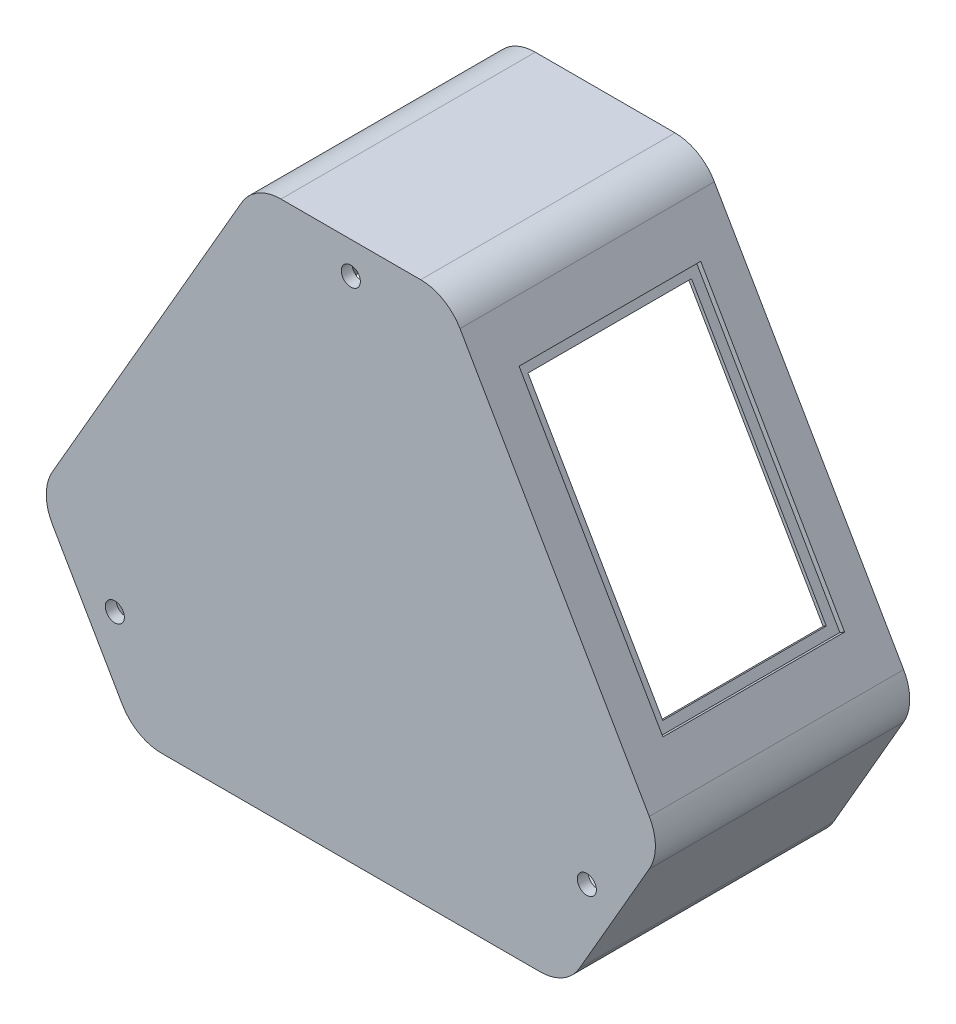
from build123d import *

# Parameters (mm, degrees)
SKETCH1_R           = 1.5
BOSS_EXTRUDE1_DEPTH = 6
SKETCH2_R           = 5.25
CUT_EXTRUDE1_DEPTH  = 233.181812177
FILLET1_R           = 20
BOSS_EXTRUDE2_DEPTH = 140
SKETCH5_W           = 100
SKETCH5_H           = 158.36
SKETCH5_W_2         = 90
SKETCH5_H_2         = 148.36
CUT_EXTRUDE2_DEPTH  = 3
SKETCH6_W           = 90
SKETCH6_H           = 148.36
CUT_EXTRUDE3_DEPTH  = 5
SKETCH7_W           = 100
SKETCH7_H           = 158.36
SKETCH7_W_2         = 90
SKETCH7_H_2         = 148.36
CUT_EXTRUDE4_DEPTH  = 3
SKETCH8_W           = 90
SKETCH8_H           = 148.36
CUT_EXTRUDE5_DEPTH  = 23


with BuildPart() as part:
    # Sketch1 → Boss-Extrude1 (new body)
    # profile 1 of 8: a face of its own
    with BuildSketch(Plane.XY):
        Polygon((-50, 162.5), (-165.729128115, -37.948729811), (-115.729128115, -124.551270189), (115.729128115, -124.551270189), (165.729128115, -37.948729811), (50, 162.5), align=None)
        with Locations((-112.279220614, -99.465454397)):
            Circle(SKETCH1_R, mode=Mode.SUBTRACT)
        with Locations((-142.279220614, -47.50393017)):
            Circle(SKETCH1_R, mode=Mode.SUBTRACT)
        with Locations((142.279220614, -47.50393017)):
            Circle(SKETCH1_R, mode=Mode.SUBTRACT)
        with Locations((112.279220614, -99.465454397)):
            Circle(SKETCH1_R, mode=Mode.SUBTRACT)
        with Locations((30, 146.969384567)):
            Circle(SKETCH1_R, mode=Mode.SUBTRACT)
        with Locations((-30, 146.969384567)):
            Circle(SKETCH1_R, mode=Mode.SUBTRACT)
        Polygon((-32.679491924, 132.5), (-131.088111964, -37.948729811), (-98.408620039, -94.551270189), (98.408620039, -94.551270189), (131.088111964, -37.948729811), (32.679491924, 132.5), align=None, mode=Mode.SUBTRACT)
    # profile 2 of 8: a face of its own
    with BuildSketch(Plane.XY):
        Polygon((-32.679491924, 132.5), (32.679491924, 132.5), (131.088111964, -37.948729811), (98.408620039, -94.551270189), (-98.408620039, -94.551270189), (-131.088111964, -37.948729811), align=None)
    # profile 3 of 8: a face of its own
    with BuildSketch(Plane.XY):
        with Locations((-30, 146.969384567)):
            Circle(SKETCH1_R)
    # profile 4 of 8: a face of its own
    with BuildSketch(Plane.XY):
        with Locations((30, 146.969384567)):
            Circle(SKETCH1_R)
    # profile 5 of 8: a face of its own
    with BuildSketch(Plane.XY):
        with Locations((142.279220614, -47.50393017)):
            Circle(SKETCH1_R)
    # profile 6 of 8: a face of its own
    with BuildSketch(Plane.XY):
        with Locations((112.279220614, -99.465454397)):
            Circle(SKETCH1_R)
    # profile 7 of 8: a face of its own
    with BuildSketch(Plane.XY):
        with Locations((-112.279220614, -99.465454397)):
            Circle(SKETCH1_R)
    # profile 8 of 8: a face of its own
    with BuildSketch(Plane.XY):
        with Locations((-142.279220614, -47.50393017)):
            Circle(SKETCH1_R)
    extrude(amount=BOSS_EXTRUDE1_DEPTH)

    # Sketch2 → Cut-Extrude1 (cut, through all)
    with BuildSketch(Plane.XY.offset(6)):
        with Locations((0, 150)):
            Circle(SKETCH2_R)
        with Locations((129.903810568, -75)):
            Circle(SKETCH2_R)
        with Locations((-129.903810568, -75)):
            Circle(SKETCH2_R)
    extrude(amount=-CUT_EXTRUDE1_DEPTH, mode=Mode.SUBTRACT)

    # Fillet1
    fillet1_edges = [part.edges().sort_by_distance(p)[0] for p in [
        (-50, 162.5, 3),
        (50, 162.5, 3),
        (165.729128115, -37.948729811, 3),
        (115.729128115, -124.551270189, 3),
        (-115.729128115, -124.551270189, 3),
        (-165.729128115, -37.948729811, 3),
    ]]
    fillet(fillet1_edges, radius=FILLET1_R)

    # Sketch3 → Boss-Extrude2 (add)
    with BuildSketch(Plane.XY.offset(6)):
        with BuildLine():
            Line((38.452994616, 167.5), (-38.452994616, 167.5))
            ThreePointArc((-38.452994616, 167.5), (-50.952994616, 164.150635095), (-60.103629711, 155))
            Line((-60.103629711, 155), (-164.285752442, -25.448729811))
            ThreePointArc((-164.285752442, -25.448729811), (-167.635117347, -37.948729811), (-164.285752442, -50.448729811))
            Line((-164.285752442, -50.448729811), (-125.832757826, -117.051270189))
            ThreePointArc((-125.832757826, -117.051270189), (-116.682122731, -126.201905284), (-104.182122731, -129.551270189))
            Line((-104.182122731, -129.551270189), (104.182122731, -129.551270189))
            ThreePointArc((104.182122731, -129.551270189), (116.682122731, -126.201905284), (125.832757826, -117.051270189))
            Line((125.832757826, -117.051270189), (164.285752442, -50.448729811))
            ThreePointArc((164.285752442, -50.448729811), (167.635117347, -37.948729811), (164.285752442, -25.448729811))
            Line((164.285752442, -25.448729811), (60.103629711, 155))
            ThreePointArc((60.103629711, 155), (50.952994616, 164.150635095), (38.452994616, 167.5))
        make_face()
        with BuildLine():
            Line((38.452994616, 162.5), (-38.452994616, 162.5))
            ThreePointArc((-38.452994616, 162.5), (-48.452994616, 159.820508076), (-55.773502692, 152.5))
            Line((-55.773502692, 152.5), (-159.955625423, -27.948729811))
            ThreePointArc((-159.955625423, -27.948729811), (-162.635117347, -37.948729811), (-159.955625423, -47.948729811))
            Line((-159.955625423, -47.948729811), (-121.502630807, -114.551270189))
            ThreePointArc((-121.502630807, -114.551270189), (-114.182122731, -121.871778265), (-104.182122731, -124.551270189))
            Line((-104.182122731, -124.551270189), (104.182122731, -124.551270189))
            ThreePointArc((104.182122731, -124.551270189), (114.182122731, -121.871778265), (121.502630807, -114.551270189))
            Line((121.502630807, -114.551270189), (159.955625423, -47.948729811))
            ThreePointArc((159.955625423, -47.948729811), (162.635117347, -37.948729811), (159.955625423, -27.948729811))
            Line((159.955625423, -27.948729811), (55.773502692, 152.5))
            ThreePointArc((55.773502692, 152.5), (48.452994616, 159.820508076), (38.452994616, 162.5))
        make_face(mode=Mode.SUBTRACT)
    extrude(amount=-BOSS_EXTRUDE2_DEPTH)

    # Sketch5 → Cut-Extrude2 (cut)
    with BuildSketch(Plane(origin=(-112.194691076, 64.775635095, 0), x_dir=(0, 0, 1), z_dir=(-0.8660254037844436, 0.4999999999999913, 0))):
        with Locations((-64, 0)):
            Rectangle(SKETCH5_W, SKETCH5_H)
        with Locations((-64, 0)):
            Rectangle(SKETCH5_W_2, SKETCH5_H_2, mode=Mode.SUBTRACT)
    extrude(amount=-CUT_EXTRUDE2_DEPTH, mode=Mode.SUBTRACT)

    # Sketch6 → Cut-Extrude3 (cut)
    with BuildSketch(Plane(origin=(-112.194691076, 64.775635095, 0), x_dir=(0, 0, 1), z_dir=(-0.8660254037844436, 0.4999999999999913, 0))):
        with Locations((-64, 0)):
            Rectangle(SKETCH6_W, SKETCH6_H)
    extrude(amount=-CUT_EXTRUDE3_DEPTH, mode=Mode.SUBTRACT)

    # Sketch7 → Cut-Extrude4 (cut)
    with BuildSketch(Plane(origin=(112.194691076, 64.775635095, 0), x_dir=(0, 0, -1), z_dir=(0.8660254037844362, 0.5000000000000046, 0))):
        with Locations((64, 0)):
            Rectangle(SKETCH7_W, SKETCH7_H)
        with Locations((64, 0)):
            Rectangle(SKETCH7_W_2, SKETCH7_H_2, mode=Mode.SUBTRACT)
    extrude(amount=-CUT_EXTRUDE4_DEPTH, mode=Mode.SUBTRACT)

    # Sketch8 → Cut-Extrude5 (cut)
    with BuildSketch(Plane(origin=(112.194691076, 64.775635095, 0), x_dir=(0, 0, -1), z_dir=(0.8660254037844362, 0.5000000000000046, 0))):
        with Locations((64, 0)):
            Rectangle(SKETCH8_W, SKETCH8_H)
    extrude(amount=-CUT_EXTRUDE5_DEPTH, mode=Mode.SUBTRACT)


solid = part.part
